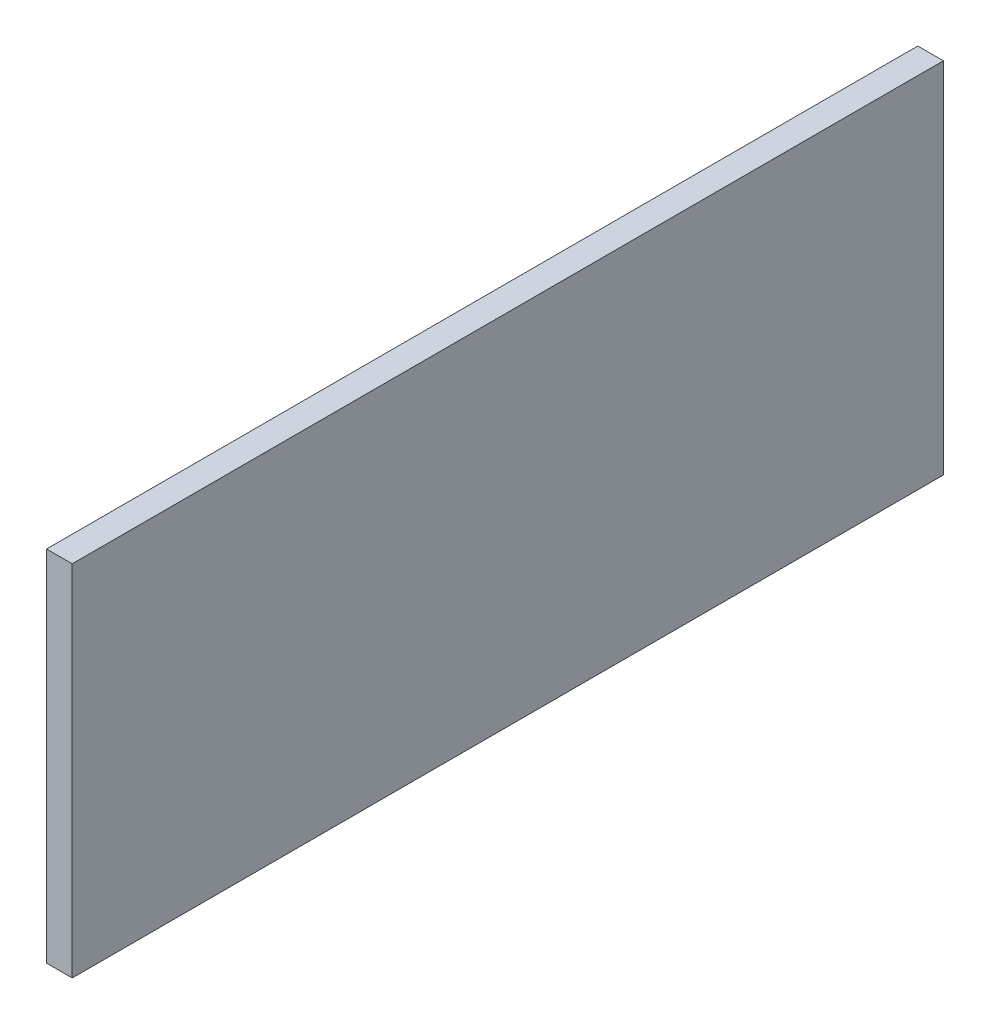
from build123d import *

# Parameters (mm, degrees)
SKETCH3_W           = 25.4
SKETCH3_H           = 863.6
BOSS_EXTRUDE1_DEPTH = 355.6


with BuildPart() as part:
    # Sketch3 → Boss-Extrude1 (new body)
    with BuildSketch(Plane(origin=(0, 0, 0), x_dir=(1, 0, 0), z_dir=(0, 1, 0))):
        with Locations((12.7, 431.8)):
            Rectangle(SKETCH3_W, SKETCH3_H)
    extrude(amount=BOSS_EXTRUDE1_DEPTH)


solid = part.part
